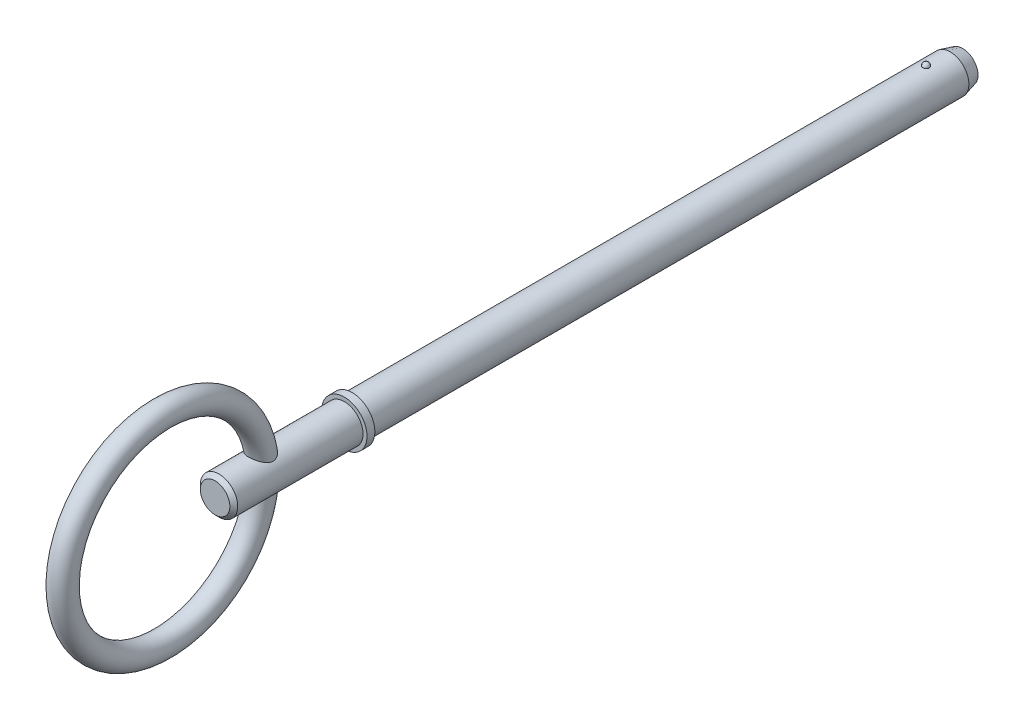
ISO-10303-21;
HEADER;
FILE_DESCRIPTION(('STEP AP214'),'2;1');
FILE_NAME('part.step','',(''),(''),'','','');
FILE_SCHEMA(('AUTOMOTIVE_DESIGN { 1 0 10303 214 1 1 1 1 }'));
ENDSEC;
DATA;
#1=APPLICATION_CONTEXT('core data for automotive mechanical design processes');
#2=APPLICATION_PROTOCOL_DEFINITION('international standard','automotive_design',2000,#1);
#3=PRODUCT_CONTEXT('',#1,'mechanical');
#4=PRODUCT('Part','Part','',(#3));
#5=PRODUCT_RELATED_PRODUCT_CATEGORY('part','',(#4));
#6=PRODUCT_DEFINITION_FORMATION('','',#4);
#7=PRODUCT_DEFINITION_CONTEXT('part definition',#1,'design');
#8=PRODUCT_DEFINITION('design','',#6,#7);
#9=PRODUCT_DEFINITION_SHAPE('','',#8);
#10=(LENGTH_UNIT() NAMED_UNIT(*) SI_UNIT(.MILLI.,.METRE.));
#11=(NAMED_UNIT(*) PLANE_ANGLE_UNIT() SI_UNIT($,.RADIAN.));
#12=(NAMED_UNIT(*) SI_UNIT($,.STERADIAN.) SOLID_ANGLE_UNIT());
#13=UNCERTAINTY_MEASURE_WITH_UNIT(LENGTH_MEASURE(1.E-05),#10,'distance_accuracy_value','');
#14=(GEOMETRIC_REPRESENTATION_CONTEXT(3) GLOBAL_UNCERTAINTY_ASSIGNED_CONTEXT((#13)) GLOBAL_UNIT_ASSIGNED_CONTEXT((#10,
#11,#12)) REPRESENTATION_CONTEXT('',''));
#15=CARTESIAN_POINT('',(0.,0.,0.));
#16=DIRECTION('',(0.,0.,1.));
#17=DIRECTION('',(1.,0.,0.));
#18=AXIS2_PLACEMENT_3D('',#15,#16,#17);
#19=CARTESIAN_POINT('',(0.,0.,72.6));
#20=DIRECTION('',(0.,0.,-1.));
#21=DIRECTION('',(-1.,0.,0.));
#22=AXIS2_PLACEMENT_3D('',#19,#20,#21);
#23=CYLINDRICAL_SURFACE('',#22,2.38);
#24=CARTESIAN_POINT('',(0.418361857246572,2.34294117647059,-0.419999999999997));
#25=CARTESIAN_POINT('',(0.418361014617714,2.34294160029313,-0.396453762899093));
#26=CARTESIAN_POINT('',(0.416399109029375,2.34329426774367,-0.372895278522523));
#27=CARTESIAN_POINT('',(0.408599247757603,2.34466666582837,-0.32643458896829));
#28=CARTESIAN_POINT('',(0.402757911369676,2.34568697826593,-0.303532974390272));
#29=CARTESIAN_POINT('',(0.387358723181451,2.3482789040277,-0.259059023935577));
#30=CARTESIAN_POINT('',(0.377802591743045,2.34985026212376,-0.237486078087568));
#31=CARTESIAN_POINT('',(0.355233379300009,2.35336760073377,-0.196270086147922));
#32=CARTESIAN_POINT('',(0.34222083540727,2.3553135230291,-0.176626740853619));
#33=CARTESIAN_POINT('',(0.313060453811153,2.35936636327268,-0.139777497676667));
#34=CARTESIAN_POINT('',(0.296906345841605,2.36147359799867,-0.122576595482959));
#35=CARTESIAN_POINT('',(0.261921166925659,2.3656092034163,-0.0911421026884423));
#36=CARTESIAN_POINT('',(0.243090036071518,2.36763757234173,-0.0769085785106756));
#37=CARTESIAN_POINT('',(0.203297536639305,2.37138533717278,-0.0518262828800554));
#38=CARTESIAN_POINT('',(0.182338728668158,2.37310509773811,-0.0409735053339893));
#39=CARTESIAN_POINT('',(0.138864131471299,2.37604521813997,-0.0229395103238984));
#40=CARTESIAN_POINT('',(0.116348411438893,2.37726560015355,-0.0157581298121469));
#41=CARTESIAN_POINT('',(0.0705754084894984,2.37906276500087,-0.00531205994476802));
#42=CARTESIAN_POINT('',(0.0473247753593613,2.37964420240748,-0.00201903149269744));
#43=CARTESIAN_POINT('',(0.000593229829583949,2.38011460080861,0.000651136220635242));
#44=CARTESIAN_POINT('',(-0.0228876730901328,2.38000359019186,2.84360175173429E-05));
#45=CARTESIAN_POINT('',(-0.0692686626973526,2.37910422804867,-0.00509943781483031));
#46=CARTESIAN_POINT('',(-0.0921713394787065,2.37831983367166,-0.00958192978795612));
#47=CARTESIAN_POINT('',(-0.136890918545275,2.37616546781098,-0.022272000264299));
#48=CARTESIAN_POINT('',(-0.158707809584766,2.37479549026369,-0.0304796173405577));
#49=CARTESIAN_POINT('',(-0.200704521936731,2.37161607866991,-0.0504168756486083));
#50=CARTESIAN_POINT('',(-0.220879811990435,2.36980547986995,-0.0621558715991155));
#51=CARTESIAN_POINT('',(-0.258974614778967,2.36594575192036,-0.0888218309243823));
#52=CARTESIAN_POINT('',(-0.276894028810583,2.36389661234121,-0.103748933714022));
#53=CARTESIAN_POINT('',(-0.310124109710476,2.35976825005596,-0.136509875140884));
#54=CARTESIAN_POINT('',(-0.325413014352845,2.35768891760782,-0.154365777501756));
#55=CARTESIAN_POINT('',(-0.352793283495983,2.35374782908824,-0.192402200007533));
#56=CARTESIAN_POINT('',(-0.364884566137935,2.35188607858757,-0.212582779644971));
#57=CARTESIAN_POINT('',(-0.385587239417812,2.34858114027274,-0.254794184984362));
#58=CARTESIAN_POINT('',(-0.394183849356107,2.34713973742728,-0.276832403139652));
#59=CARTESIAN_POINT('',(-0.407590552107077,2.3448489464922,-0.322061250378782));
#60=CARTESIAN_POINT('',(-0.412400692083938,2.34399955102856,-0.34525186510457));
#61=CARTESIAN_POINT('',(-0.418098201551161,2.34299005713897,-0.392078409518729));
#62=CARTESIAN_POINT('',(-0.41899328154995,2.34282860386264,-0.415713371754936));
#63=CARTESIAN_POINT('',(-0.416857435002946,2.34320955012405,-0.462799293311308));
#64=CARTESIAN_POINT('',(-0.413826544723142,2.34375194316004,-0.486250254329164));
#65=CARTESIAN_POINT('',(-0.403929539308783,2.34547773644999,-0.532261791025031));
#66=CARTESIAN_POINT('',(-0.397069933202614,2.34666004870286,-0.554823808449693));
#67=CARTESIAN_POINT('',(-0.379705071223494,2.34953208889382,-0.59846383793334));
#68=CARTESIAN_POINT('',(-0.369199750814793,2.35122182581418,-0.61954182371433));
#69=CARTESIAN_POINT('',(-0.344797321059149,2.35492396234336,-0.659671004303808));
#70=CARTESIAN_POINT('',(-0.33089223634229,2.35693711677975,-0.678717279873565));
#71=CARTESIAN_POINT('',(-0.300080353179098,2.36105754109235,-0.714192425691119));
#72=CARTESIAN_POINT('',(-0.283173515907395,2.36316481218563,-0.730621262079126));
#73=CARTESIAN_POINT('',(-0.246801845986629,2.36723962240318,-0.760416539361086));
#74=CARTESIAN_POINT('',(-0.227334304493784,2.36920701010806,-0.773779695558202));
#75=CARTESIAN_POINT('',(-0.186398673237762,2.37277833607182,-0.797042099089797));
#76=CARTESIAN_POINT('',(-0.164930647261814,2.37438228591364,-0.806941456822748));
#77=CARTESIAN_POINT('',(-0.120727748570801,2.37703848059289,-0.82294821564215));
#78=CARTESIAN_POINT('',(-0.0980005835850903,2.37809374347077,-0.829076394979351));
#79=CARTESIAN_POINT('',(-0.0518218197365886,2.37954782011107,-0.837451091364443));
#80=CARTESIAN_POINT('',(-0.0283702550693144,2.37994666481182,-0.839697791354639));
#81=CARTESIAN_POINT('',(0.0184023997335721,2.38004290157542,-0.840243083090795));
#82=CARTESIAN_POINT('',(0.0417231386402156,2.37974556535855,-0.838571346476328));
#83=CARTESIAN_POINT('',(0.0877471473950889,2.37849333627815,-0.831389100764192));
#84=CARTESIAN_POINT('',(0.110450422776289,2.37753844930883,-0.825878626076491));
#85=CARTESIAN_POINT('',(0.154584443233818,2.37507730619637,-0.811179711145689));
#86=CARTESIAN_POINT('',(0.17601599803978,2.37357140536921,-0.801993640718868));
#87=CARTESIAN_POINT('',(0.217028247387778,2.37017355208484,-0.780200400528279));
#88=CARTESIAN_POINT('',(0.236608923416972,2.36828159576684,-0.767593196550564));
#89=CARTESIAN_POINT('',(0.27351405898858,2.36430486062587,-0.739207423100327));
#90=CARTESIAN_POINT('',(0.290821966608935,2.36221883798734,-0.723407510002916));
#91=CARTESIAN_POINT('',(0.322554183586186,2.3580957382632,-0.68912612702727));
#92=CARTESIAN_POINT('',(0.336977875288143,2.35605867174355,-0.670644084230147));
#93=CARTESIAN_POINT('',(0.362636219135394,2.35224677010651,-0.63138169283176));
#94=CARTESIAN_POINT('',(0.373848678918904,2.35047379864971,-0.610586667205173));
#95=CARTESIAN_POINT('',(0.392641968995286,2.34740786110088,-0.567397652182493));
#96=CARTESIAN_POINT('',(0.400225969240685,2.34611447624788,-0.545005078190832));
#97=CARTESIAN_POINT('',(0.410033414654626,2.34441668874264,-0.505456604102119));
#98=CARTESIAN_POINT('',(0.413152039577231,2.34386644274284,-0.488523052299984));
#99=CARTESIAN_POINT('',(0.417316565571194,2.34312853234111,-0.454395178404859));
#100=CARTESIAN_POINT('',(0.418362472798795,2.34294086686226,-0.437200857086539));
#101=CARTESIAN_POINT('',(0.418361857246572,2.34294117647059,-0.419999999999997));
#102=B_SPLINE_CURVE_WITH_KNOTS('',3,(#24,#25,#26,#27,#28,#29,#30,#31,#32,#33,#34,#35,#36,#37,
#38,#39,#40,#41,#42,#43,#44,#45,#46,#47,#48,#49,#50,#51,#52,#53,#54,#55,#56,#57,#58,#59,#60,#61,
#62,#63,#64,#65,#66,#67,#68,#69,#70,#71,#72,#73,#74,#75,#76,#77,#78,#79,#80,#81,#82,#83,#84,#85,
#86,#87,#88,#89,#90,#91,#92,#93,#94,#95,#96,#97,#98,#99,#100,#101),.UNSPECIFIED.,.T.,.F.,(4,2,2,
2,2,2,2,2,2,2,2,2,2,2,2,2,2,2,2,2,2,2,2,2,2,2,2,2,2,2,2,2,2,2,2,2,2,2,4),(0.,0.0705763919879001,
0.141214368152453,0.211819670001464,0.282414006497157,0.353150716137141,0.423889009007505,
0.494543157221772,0.565194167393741,0.635327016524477,0.705456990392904,0.77517764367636,
0.844899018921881,0.914806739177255,0.98471751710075,1.05518143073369,1.1256471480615,
1.19640787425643,1.26716771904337,1.33778814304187,1.40840791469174,1.47890799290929,
1.54940931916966,1.62007764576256,1.69074688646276,1.76149149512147,1.83223384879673,
1.90258285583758,1.97292854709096,2.04274328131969,2.11255738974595,2.18232655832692,
2.25209642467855,2.32234913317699,2.39261687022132,2.4633591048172,2.5340394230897,
2.58559662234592,2.63715366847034),.UNSPECIFIED.);
#103=CARTESIAN_POINT('',(0.418361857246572,2.34294117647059,-0.419999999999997));
#104=VERTEX_POINT('',#103);
#105=EDGE_CURVE('E103',#104,#104,#102,.T.);
#106=ORIENTED_EDGE('',*,*,#105,.T.);
#107=EDGE_LOOP('',(#106));
#108=FACE_BOUND('',#107,.T.);
#109=CARTESIAN_POINT('',(0.,0.,-3.49399999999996));
#110=DIRECTION('',(0.,0.,-1.));
#111=DIRECTION('',(-1.,0.,0.));
#112=AXIS2_PLACEMENT_3D('',#109,#110,#111);
#113=CIRCLE('',#112,2.38);
#114=CARTESIAN_POINT('',(-2.38,0.,-3.49399999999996));
#115=VERTEX_POINT('',#114);
#116=EDGE_CURVE('E110',#115,#115,#113,.F.);
#117=ORIENTED_EDGE('',*,*,#116,.T.);
#118=EDGE_LOOP('',(#117));
#119=FACE_BOUND('',#118,.T.);
#120=CARTESIAN_POINT('',(0.,0.,72.6));
#121=DIRECTION('',(0.,0.,1.));
#122=DIRECTION('',(1.,0.,0.));
#123=AXIS2_PLACEMENT_3D('',#120,#121,#122);
#124=CIRCLE('',#123,2.38);
#125=CARTESIAN_POINT('',(2.38,0.,72.6));
#126=VERTEX_POINT('',#125);
#127=EDGE_CURVE('E108',#126,#126,#124,.T.);
#128=ORIENTED_EDGE('',*,*,#127,.F.);
#129=EDGE_LOOP('',(#128));
#130=FACE_BOUND('',#129,.T.);
#131=ADVANCED_FACE('F39',(#108,#119,#130),#23,.T.);
#132=CARTESIAN_POINT('',(0.,0.,-5.08));
#133=DIRECTION('',(0.,0.,-1.));
#134=DIRECTION('',(-1.,0.,0.));
#135=AXIS2_PLACEMENT_3D('',#132,#133,#134);
#136=PLANE('',#135);
#137=CARTESIAN_POINT('',(0.,0.,-5.08));
#138=DIRECTION('',(0.,0.,-1.));
#139=DIRECTION('',(-1.,0.,0.));
#140=AXIS2_PLACEMENT_3D('',#137,#138,#139);
#141=CIRCLE('',#140,1.95503258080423);
#142=CARTESIAN_POINT('',(-1.95503258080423,0.,-5.08));
#143=VERTEX_POINT('',#142);
#144=EDGE_CURVE('E143',#143,#143,#141,.T.);
#145=ORIENTED_EDGE('',*,*,#144,.T.);
#146=EDGE_LOOP('',(#145));
#147=FACE_BOUND('',#146,.T.);
#148=ADVANCED_FACE('F89',(#147),#136,.T.);
#149=CARTESIAN_POINT('',(0.,0.,-5.08));
#150=DIRECTION('',(0.,0.,1.));
#151=DIRECTION('',(1.,0.,0.));
#152=AXIS2_PLACEMENT_3D('',#149,#150,#151);
#153=CONICAL_SURFACE('',#152,1.95503258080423,0.261799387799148);
#154=ORIENTED_EDGE('',*,*,#116,.F.);
#155=EDGE_LOOP('',(#154));
#156=FACE_BOUND('',#155,.T.);
#157=ORIENTED_EDGE('',*,*,#144,.F.);
#158=EDGE_LOOP('',(#157));
#159=FACE_BOUND('',#158,.T.);
#160=ADVANCED_FACE('F95',(#156,#159),#153,.T.);
#161=CARTESIAN_POINT('',(0.,2.38,-0.419999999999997));
#162=DIRECTION('',(0.,1.,0.));
#163=DIRECTION('',(0.,0.,1.));
#164=AXIS2_PLACEMENT_3D('',#161,#162,#163);
#165=SPHERICAL_SURFACE('',#164,0.419999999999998);
#166=ORIENTED_EDGE('',*,*,#105,.F.);
#167=EDGE_LOOP('',(#166));
#168=FACE_BOUND('',#167,.T.);
#169=ADVANCED_FACE('F113',(#168),#165,.T.);
#170=CARTESIAN_POINT('',(0.,0.,72.6));
#171=DIRECTION('',(0.,0.,-1.));
#172=DIRECTION('',(-1.,0.,0.));
#173=AXIS2_PLACEMENT_3D('',#170,#171,#172);
#174=PLANE('',#173);
#175=ORIENTED_EDGE('',*,*,#127,.T.);
#176=EDGE_LOOP('',(#175));
#177=FACE_BOUND('',#176,.T.);
#178=CARTESIAN_POINT('',(0.,0.,72.6));
#179=DIRECTION('',(0.,0.,-1.));
#180=DIRECTION('',(-1.,0.,0.));
#181=AXIS2_PLACEMENT_3D('',#178,#179,#180);
#182=CIRCLE('',#181,2.88);
#183=CARTESIAN_POINT('',(-2.88,0.,72.6));
#184=VERTEX_POINT('',#183);
#185=EDGE_CURVE('E109',#184,#184,#182,.T.);
#186=ORIENTED_EDGE('',*,*,#185,.T.);
#187=EDGE_LOOP('',(#186));
#188=FACE_BOUND('',#187,.T.);
#189=ADVANCED_FACE('F117',(#177,#188),#174,.T.);
#190=CARTESIAN_POINT('',(0.,0.,33.7287874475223));
#191=DIRECTION('',(0.,0.,-1.));
#192=DIRECTION('',(-1.,0.,0.));
#193=AXIS2_PLACEMENT_3D('',#190,#191,#192);
#194=CYLINDRICAL_SURFACE('',#193,2.88);
#195=CARTESIAN_POINT('',(0.,0.,73.6));
#196=DIRECTION('',(0.,0.,-1.));
#197=DIRECTION('',(-1.,0.,0.));
#198=AXIS2_PLACEMENT_3D('',#195,#196,#197);
#199=CIRCLE('',#198,2.88);
#200=CARTESIAN_POINT('',(-2.88,0.,73.6));
#201=VERTEX_POINT('',#200);
#202=EDGE_CURVE('E134',#201,#201,#199,.T.);
#203=ORIENTED_EDGE('',*,*,#202,.T.);
#204=EDGE_LOOP('',(#203));
#205=FACE_BOUND('',#204,.T.);
#206=ORIENTED_EDGE('',*,*,#185,.F.);
#207=EDGE_LOOP('',(#206));
#208=FACE_BOUND('',#207,.T.);
#209=ADVANCED_FACE('F121',(#205,#208),#194,.T.);
#210=CARTESIAN_POINT('',(0.,2.88,73.6));
#211=DIRECTION('',(0.,0.,1.));
#212=DIRECTION('',(1.,0.,0.));
#213=AXIS2_PLACEMENT_3D('',#210,#211,#212);
#214=PLANE('',#213);
#215=CARTESIAN_POINT('',(0.,0.,73.6));
#216=DIRECTION('',(0.,0.,1.));
#217=DIRECTION('',(1.,0.,0.));
#218=AXIS2_PLACEMENT_3D('',#215,#216,#217);
#219=CIRCLE('',#218,2.38);
#220=CARTESIAN_POINT('',(2.38,0.,73.6));
#221=VERTEX_POINT('',#220);
#222=EDGE_CURVE('E112',#221,#221,#219,.T.);
#223=ORIENTED_EDGE('',*,*,#222,.F.);
#224=EDGE_LOOP('',(#223));
#225=FACE_BOUND('',#224,.T.);
#226=ORIENTED_EDGE('',*,*,#202,.F.);
#227=EDGE_LOOP('',(#226));
#228=FACE_BOUND('',#227,.T.);
#229=ADVANCED_FACE('F86',(#225,#228),#214,.T.);
#230=CARTESIAN_POINT('',(0.,0.,90.05));
#231=DIRECTION('',(0.,0.,-1.));
#232=DIRECTION('',(-1.,0.,0.));
#233=AXIS2_PLACEMENT_3D('',#230,#231,#232);
#234=CYLINDRICAL_SURFACE('',#233,2.38);
#235=CARTESIAN_POINT('',(-0.903407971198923,-2.20187511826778,83.028101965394));
#236=CARTESIAN_POINT('',(-0.839710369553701,-2.22800560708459,82.9836275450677));
#237=CARTESIAN_POINT('',(-0.771955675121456,-2.25255828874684,82.9439200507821));
#238=CARTESIAN_POINT('',(-0.629623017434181,-2.29641711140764,82.8749006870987));
#239=CARTESIAN_POINT('',(-0.555034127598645,-2.31571464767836,82.8456058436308));
#240=CARTESIAN_POINT('',(-0.400673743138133,-2.34735542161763,82.7982943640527));
#241=CARTESIAN_POINT('',(-0.320887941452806,-2.35967847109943,82.7803104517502));
#242=CARTESIAN_POINT('',(-0.158738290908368,-2.37609587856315,82.7564617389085));
#243=CARTESIAN_POINT('',(-0.0763765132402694,-2.38019668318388,82.7505874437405));
#244=CARTESIAN_POINT('',(0.083665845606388,-2.3797998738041,82.7511603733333));
#245=CARTESIAN_POINT('',(0.161351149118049,-2.37576936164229,82.7569382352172));
#246=CARTESIAN_POINT('',(0.314409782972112,-2.36039486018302,82.7792676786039));
#247=CARTESIAN_POINT('',(0.389782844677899,-2.34905002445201,82.7958205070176));
#248=CARTESIAN_POINT('',(0.535937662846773,-2.32006569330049,82.8390515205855));
#249=CARTESIAN_POINT('',(0.60673584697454,-2.30245039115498,82.8656908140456));
#250=CARTESIAN_POINT('',(0.742521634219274,-2.26231731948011,82.9283720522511));
#251=CARTESIAN_POINT('',(0.807508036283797,-2.23979853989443,82.9644159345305));
#252=CARTESIAN_POINT('',(0.935326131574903,-2.18966592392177,83.0483563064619));
#253=CARTESIAN_POINT('',(0.997591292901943,-2.16179128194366,83.0969595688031));
#254=CARTESIAN_POINT('',(1.11292144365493,-2.10474548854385,83.2035603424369));
#255=CARTESIAN_POINT('',(1.16597568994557,-2.07557287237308,83.2615686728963));
#256=CARTESIAN_POINT('',(1.26477130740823,-2.01699124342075,83.3902977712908));
#257=CARTESIAN_POINT('',(1.30983402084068,-1.98768494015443,83.4615920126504));
#258=CARTESIAN_POINT('',(1.38660631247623,-1.93491744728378,83.6129637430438));
#259=CARTESIAN_POINT('',(1.41834090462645,-1.91144534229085,83.6930244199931));
#260=CARTESIAN_POINT('',(1.46422131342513,-1.87648847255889,83.8506940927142));
#261=CARTESIAN_POINT('',(1.47990731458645,-1.86397592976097,83.9276190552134));
#262=CARTESIAN_POINT('',(1.49871691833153,-1.84889326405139,84.0838974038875));
#263=CARTESIAN_POINT('',(1.50185388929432,-1.84631256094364,84.1632481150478));
#264=CARTESIAN_POINT('',(1.4964844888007,-1.85065563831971,84.3088470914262));
#265=CARTESIAN_POINT('',(1.48970686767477,-1.85616871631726,84.3752204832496));
#266=CARTESIAN_POINT('',(1.46828795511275,-1.87315650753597,84.5059075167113));
#267=CARTESIAN_POINT('',(1.4536391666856,-1.88463690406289,84.5702191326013));
#268=CARTESIAN_POINT('',(1.40943250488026,-1.91806137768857,84.7230643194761));
#269=CARTESIAN_POINT('',(1.37616344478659,-1.94238425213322,84.8099991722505));
#270=CARTESIAN_POINT('',(1.29708737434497,-1.99605834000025,84.9763485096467));
#271=CARTESIAN_POINT('',(1.25125268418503,-2.02542060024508,85.055745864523));
#272=CARTESIAN_POINT('',(1.14695036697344,-2.08629729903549,85.2076285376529));
#273=CARTESIAN_POINT('',(1.08823347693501,-2.11784433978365,85.2799296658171));
#274=CARTESIAN_POINT('',(0.959228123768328,-2.17930599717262,85.4140708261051));
#275=CARTESIAN_POINT('',(0.888958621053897,-2.20922318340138,85.4759276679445));
#276=CARTESIAN_POINT('',(0.753368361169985,-2.25851185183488,85.5749333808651));
#277=CARTESIAN_POINT('',(0.690173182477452,-2.2787729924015,85.6145392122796));
#278=CARTESIAN_POINT('',(0.557409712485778,-2.31482439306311,85.6839846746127));
#279=CARTESIAN_POINT('',(0.487846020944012,-2.33061784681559,85.7138312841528));
#280=CARTESIAN_POINT('',(0.342953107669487,-2.35631858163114,85.7620255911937));
#281=CARTESIAN_POINT('',(0.26757466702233,-2.36616750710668,85.780259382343));
#282=CARTESIAN_POINT('',(0.114199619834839,-2.37849775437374,85.8030468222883));
#283=CARTESIAN_POINT('',(0.0362059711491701,-2.3809871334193,85.8076154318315));
#284=CARTESIAN_POINT('',(-0.107568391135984,-2.37849121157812,85.8030163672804));
#285=CARTESIAN_POINT('',(-0.173440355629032,-2.37456249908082,85.795790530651));
#286=CARTESIAN_POINT('',(-0.302853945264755,-2.36154811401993,85.7716908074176));
#287=CARTESIAN_POINT('',(-0.366395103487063,-2.35246141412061,85.7548149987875));
#288=CARTESIAN_POINT('',(-0.489880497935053,-2.32988758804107,85.7124346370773));
#289=CARTESIAN_POINT('',(-0.549812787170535,-2.31638670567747,85.6869031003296));
#290=CARTESIAN_POINT('',(-0.665021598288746,-2.28597979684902,85.6284893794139));
#291=CARTESIAN_POINT('',(-0.720295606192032,-2.26907194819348,85.5956032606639));
#292=CARTESIAN_POINT('',(-0.851132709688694,-2.22413718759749,85.5063110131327));
#293=CARTESIAN_POINT('',(-0.923680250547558,-2.19467168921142,85.4461969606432));
#294=CARTESIAN_POINT('',(-1.05722916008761,-2.13356097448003,85.3150668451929));
#295=CARTESIAN_POINT('',(-1.11820078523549,-2.10191042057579,85.2440235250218));
#296=CARTESIAN_POINT('',(-1.22894457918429,-2.0391654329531,85.0916118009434));
#297=CARTESIAN_POINT('',(-1.27853191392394,-2.00808682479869,85.0101025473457));
#298=CARTESIAN_POINT('',(-1.36422650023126,-1.95088121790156,84.8387530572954));
#299=CARTESIAN_POINT('',(-1.40036235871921,-1.92474376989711,84.7489310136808));
#300=CARTESIAN_POINT('',(-1.44943039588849,-1.88791548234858,84.5877392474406));
#301=CARTESIAN_POINT('',(-1.46600167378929,-1.87495651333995,84.5180059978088));
#302=CARTESIAN_POINT('',(-1.48984634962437,-1.8560704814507,84.3760551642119));
#303=CARTESIAN_POINT('',(-1.49713400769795,-1.85013263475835,84.303841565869));
#304=CARTESIAN_POINT('',(-1.5014924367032,-1.84660099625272,84.1583634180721));
#305=CARTESIAN_POINT('',(-1.4984943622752,-1.84906342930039,84.0850950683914));
#306=CARTESIAN_POINT('',(-1.48179888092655,-1.8624661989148,83.9405680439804));
#307=CARTESIAN_POINT('',(-1.46809860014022,-1.87340881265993,83.869309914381));
#308=CARTESIAN_POINT('',(-1.43218989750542,-1.90096973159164,83.7372815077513));
#309=CARTESIAN_POINT('',(-1.41085045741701,-1.91699396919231,83.6761429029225));
#310=CARTESIAN_POINT('',(-1.36038958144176,-1.95312601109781,83.5584385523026));
#311=CARTESIAN_POINT('',(-1.33126141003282,-1.97323734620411,83.5018768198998));
#312=CARTESIAN_POINT('',(-1.2617310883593,-2.01850590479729,83.3870500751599));
#313=CARTESIAN_POINT('',(-1.22036168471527,-2.04397945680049,83.3294985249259));
#314=CARTESIAN_POINT('',(-1.12954254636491,-2.09553139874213,83.2216488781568));
#315=CARTESIAN_POINT('',(-1.08010424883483,-2.12160888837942,83.1713407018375));
#316=CARTESIAN_POINT('',(-0.987769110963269,-2.16578285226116,83.0904848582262));
#317=CARTESIAN_POINT('',(-0.946517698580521,-2.18419033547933,83.0582016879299));
#318=CARTESIAN_POINT('',(-0.903407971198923,-2.20187511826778,83.028101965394));
#319=B_SPLINE_CURVE_WITH_KNOTS('',3,(#235,#236,#237,#238,#239,#240,#241,#242,#243,#244,#245,
#246,#247,#248,#249,#250,#251,#252,#253,#254,#255,#256,#257,#258,#259,#260,#261,#262,#263,#264,
#265,#266,#267,#268,#269,#270,#271,#272,#273,#274,#275,#276,#277,#278,#279,#280,#281,#282,#283,
#284,#285,#286,#287,#288,#289,#290,#291,#292,#293,#294,#295,#296,#297,#298,#299,#300,#301,#302,
#303,#304,#305,#306,#307,#308,#309,#310,#311,#312,#313,#314,#315,#316,#317,#318),.UNSPECIFIED.,
.T.,.F.,(4,2,2,2,2,2,2,2,2,2,2,2,2,2,2,2,2,2,2,2,2,2,2,2,2,2,2,2,2,2,2,2,2,2,2,2,2,2,2,2,2,4),
(0.,0.245727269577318,0.491854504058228,0.738690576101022,0.985333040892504,1.21821047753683,
1.45111486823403,1.68313021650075,1.9151934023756,2.16541572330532,2.41592795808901,
2.68235417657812,2.9482781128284,3.18521517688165,3.42189976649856,3.62191159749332,
3.82211427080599,4.10918949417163,4.39690224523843,4.69076958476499,4.98415935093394,
5.2151557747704,5.4459866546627,5.67904815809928,5.91185441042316,6.11003726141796,
6.3082595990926,6.50710565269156,6.70605834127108,7.00062466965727,7.29593791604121,
7.59575158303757,7.8949239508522,8.11262207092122,8.329985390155,8.54880641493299,
8.76768621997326,8.96702101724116,9.16652875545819,9.39164791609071,9.61645071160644,
9.78275580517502),.UNSPECIFIED.);
#320=CARTESIAN_POINT('',(-0.903407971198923,-2.20187511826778,83.028101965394));
#321=VERTEX_POINT('',#320);
#322=EDGE_CURVE('E10',#321,#321,#319,.T.);
#323=ORIENTED_EDGE('',*,*,#322,.F.);
#324=EDGE_LOOP('',(#323));
#325=FACE_BOUND('',#324,.T.);
#326=CARTESIAN_POINT('',(-0.903407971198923,2.20187511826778,83.028101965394));
#327=CARTESIAN_POINT('',(-0.970214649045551,2.17445928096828,83.0747550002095));
#328=CARTESIAN_POINT('',(-1.03268838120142,2.14525344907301,83.1267440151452));
#329=CARTESIAN_POINT('',(-1.14770770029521,2.0859961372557,83.2406478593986));
#330=CARTESIAN_POINT('',(-1.20022114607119,2.05594226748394,83.3025936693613));
#331=CARTESIAN_POINT('',(-1.2941155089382,1.99817720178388,83.4359266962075));
#332=CARTESIAN_POINT('',(-1.33544720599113,1.9704767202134,83.5073536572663));
#333=CARTESIAN_POINT('',(-1.40506760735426,1.92146090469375,83.6582024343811));
#334=CARTESIAN_POINT('',(-1.43339046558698,1.90012890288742,83.7376026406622));
#335=CARTESIAN_POINT('',(-1.47338334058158,1.86925714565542,83.8934496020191));
#336=CARTESIAN_POINT('',(-1.48649837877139,1.85870842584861,83.9693198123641));
#337=CARTESIAN_POINT('',(-1.50071746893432,1.8472518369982,84.12287045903));
#338=CARTESIAN_POINT('',(-1.50182784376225,1.84633889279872,84.2005499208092));
#339=CARTESIAN_POINT('',(-1.49326645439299,1.85325786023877,84.343985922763));
#340=CARTESIAN_POINT('',(-1.48506604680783,1.85989666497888,84.4099043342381));
#341=CARTESIAN_POINT('',(-1.46099386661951,1.87886395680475,84.5394790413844));
#342=CARTESIAN_POINT('',(-1.44511553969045,1.8911973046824,84.6031333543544));
#343=CARTESIAN_POINT('',(-1.39754250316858,1.92678855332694,84.7561538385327));
#344=CARTESIAN_POINT('',(-1.36192725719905,1.95245999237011,84.8437372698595));
#345=CARTESIAN_POINT('',(-1.27788657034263,2.00847209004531,85.0109907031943));
#346=CARTESIAN_POINT('',(-1.22943137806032,2.0388235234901,85.0906417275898));
#347=CARTESIAN_POINT('',(-1.11958027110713,2.10119412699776,85.2424206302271));
#348=CARTESIAN_POINT('',(-1.05794784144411,2.13323438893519,85.3143690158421));
#349=CARTESIAN_POINT('',(-0.922772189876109,2.1950849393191,85.4470807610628));
#350=CARTESIAN_POINT('',(-0.849252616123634,2.22489948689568,85.5078658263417));
#351=CARTESIAN_POINT('',(-0.710152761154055,2.27246326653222,85.6023110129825));
#352=CARTESIAN_POINT('',(-0.647015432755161,2.29138112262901,85.6389704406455));
#353=CARTESIAN_POINT('',(-0.514878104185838,2.32463484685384,85.7025884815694));
#354=CARTESIAN_POINT('',(-0.445882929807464,2.33897444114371,85.7295549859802));
#355=CARTESIAN_POINT('',(-0.302797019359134,2.36177853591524,85.7721624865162));
#356=CARTESIAN_POINT('',(-0.228666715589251,2.37019011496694,85.7877015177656));
#357=CARTESIAN_POINT('',(-0.0783799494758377,2.37989644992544,85.8056164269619));
#358=CARTESIAN_POINT('',(-0.00222521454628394,2.38119708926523,85.8080031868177));
#359=CARTESIAN_POINT('',(0.138818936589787,2.37685303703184,85.7999981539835));
#360=CARTESIAN_POINT('',(0.203841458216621,2.37212211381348,85.7912876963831));
#361=CARTESIAN_POINT('',(0.331347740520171,2.35769527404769,85.7645309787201));
#362=CARTESIAN_POINT('',(0.393830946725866,2.34799827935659,85.7464826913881));
#363=CARTESIAN_POINT('',(0.516206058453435,2.32419976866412,85.7016833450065));
#364=CARTESIAN_POINT('',(0.576015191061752,2.31000942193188,85.6747562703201));
#365=CARTESIAN_POINT('',(0.690806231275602,2.27831963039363,85.6136110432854));
#366=CARTESIAN_POINT('',(0.745785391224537,2.26081831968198,85.579388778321));
#367=CARTESIAN_POINT('',(0.876071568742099,2.2144370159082,85.4866108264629));
#368=CARTESIAN_POINT('',(0.948236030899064,2.18416686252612,85.424322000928));
#369=CARTESIAN_POINT('',(1.08068664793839,2.12176774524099,85.2888044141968));
#370=CARTESIAN_POINT('',(1.14094076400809,2.08963406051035,85.215547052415));
#371=CARTESIAN_POINT('',(1.24978363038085,2.02643655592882,85.058659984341));
#372=CARTESIAN_POINT('',(1.29819307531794,1.99539463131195,84.9748968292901));
#373=CARTESIAN_POINT('',(1.38094965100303,1.93904233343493,84.7989962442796));
#374=CARTESIAN_POINT('',(1.41533296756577,1.91371728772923,84.7068811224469));
#375=CARTESIAN_POINT('',(1.46011713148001,1.87962907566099,84.543926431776));
#376=CARTESIAN_POINT('',(1.47459501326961,1.86818653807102,84.4747778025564));
#377=CARTESIAN_POINT('',(1.49436605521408,1.8524142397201,84.334403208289));
#378=CARTESIAN_POINT('',(1.49967306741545,1.84807375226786,84.2631805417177));
#379=CARTESIAN_POINT('',(1.50029887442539,1.84756805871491,84.1202291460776));
#380=CARTESIAN_POINT('',(1.49556248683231,1.8514480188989,84.048499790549));
#381=CARTESIAN_POINT('',(1.4758165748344,1.86722196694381,83.9073512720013));
#382=CARTESIAN_POINT('',(1.46080121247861,1.87912050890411,83.8379334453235));
#383=CARTESIAN_POINT('',(1.42246467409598,1.90827733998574,83.7082199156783));
#384=CARTESIAN_POINT('',(1.39980172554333,1.92509995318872,83.6476260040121));
#385=CARTESIAN_POINT('',(1.34679091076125,1.96255086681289,83.5311857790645));
#386=CARTESIAN_POINT('',(1.31644034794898,1.98318050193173,83.4753411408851));
#387=CARTESIAN_POINT('',(1.24396057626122,2.02954647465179,83.3614514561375));
#388=CARTESIAN_POINT('',(1.20077385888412,2.05559269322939,83.3042068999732));
#389=CARTESIAN_POINT('',(1.10616417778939,2.10801594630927,83.1971320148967));
#390=CARTESIAN_POINT('',(1.05473535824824,2.13439320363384,83.1473070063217));
#391=CARTESIAN_POINT('',(0.93620270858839,2.18924478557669,83.0487347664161));
#392=CARTESIAN_POINT('',(0.867904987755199,2.21744450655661,83.0012583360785));
#393=CARTESIAN_POINT('',(0.722917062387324,2.26885521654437,82.9177494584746));
#394=CARTESIAN_POINT('',(0.646227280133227,2.29206645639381,82.8817164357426));
#395=CARTESIAN_POINT('',(0.487515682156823,2.33094430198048,82.822591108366));
#396=CARTESIAN_POINT('',(0.405587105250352,2.34671524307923,82.7993190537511));
#397=CARTESIAN_POINT('',(0.237955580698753,2.36958127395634,82.7658521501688));
#398=CARTESIAN_POINT('',(0.152255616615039,2.37668309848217,82.7556471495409));
#399=CARTESIAN_POINT('',(-0.0122990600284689,2.38126478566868,82.7490505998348));
#400=CARTESIAN_POINT('',(-0.0910885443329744,2.37954037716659,82.7515167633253));
#401=CARTESIAN_POINT('',(-0.247004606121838,2.36843740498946,82.7675699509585));
#402=CARTESIAN_POINT('',(-0.324130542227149,2.35905594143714,82.7811611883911));
#403=CARTESIAN_POINT('',(-0.473048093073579,2.33371594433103,82.8185984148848));
#404=CARTESIAN_POINT('',(-0.544914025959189,2.31788812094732,82.8422409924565));
#405=CARTESIAN_POINT('',(-0.683201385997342,2.28095222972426,82.8990265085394));
#406=CARTESIAN_POINT('',(-0.74963171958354,2.25985303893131,82.9321534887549));
#407=CARTESIAN_POINT('',(-0.843767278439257,2.22565914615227,82.9880726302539));
#408=CARTESIAN_POINT('',(-0.874007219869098,2.21394047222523,83.0075705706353));
#409=CARTESIAN_POINT('',(-0.903407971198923,2.20187511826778,83.028101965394));
#410=B_SPLINE_CURVE_WITH_KNOTS('',3,(#326,#327,#328,#329,#330,#331,#332,#333,#334,#335,#336,
#337,#338,#339,#340,#341,#342,#343,#344,#345,#346,#347,#348,#349,#350,#351,#352,#353,#354,#355,
#356,#357,#358,#359,#360,#361,#362,#363,#364,#365,#366,#367,#368,#369,#370,#371,#372,#373,#374,
#375,#376,#377,#378,#379,#380,#381,#382,#383,#384,#385,#386,#387,#388,#389,#390,#391,#392,#393,
#394,#395,#396,#397,#398,#399,#400,#401,#402,#403,#404,#405,#406,#407,#408,#409),.UNSPECIFIED.,
.T.,.F.,(4,2,2,2,2,2,2,2,2,2,2,2,2,2,2,2,2,2,2,2,2,2,2,2,2,2,2,2,2,2,2,2,2,2,2,2,2,2,2,2,2,4),
(0.,0.257815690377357,0.516449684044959,0.776204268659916,1.03527292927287,1.26692758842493,
1.49846022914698,1.69794041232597,1.89759118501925,2.1899309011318,2.48295401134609,
2.78175997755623,3.07997865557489,3.30539912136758,3.53063565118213,3.75785831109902,
3.98489294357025,4.18128296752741,4.37771564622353,4.57830350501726,4.77900474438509,
5.07746482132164,5.37671714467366,5.68025255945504,5.982999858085,6.19688795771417,
6.41045270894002,6.62519390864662,6.84005717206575,7.03981304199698,7.23963907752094,
7.46764796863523,7.69581957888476,7.9580466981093,8.2202606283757,8.47867938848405,
8.73689726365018,8.97226876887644,9.20772945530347,9.43863631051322,9.66915690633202,
9.78261824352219),.UNSPECIFIED.);
#411=CARTESIAN_POINT('',(-0.903407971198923,2.20187511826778,83.028101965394));
#412=VERTEX_POINT('',#411);
#413=EDGE_CURVE('E51',#412,#412,#410,.T.);
#414=ORIENTED_EDGE('',*,*,#413,.F.);
#415=EDGE_LOOP('',(#414));
#416=FACE_BOUND('',#415,.T.);
#417=CARTESIAN_POINT('',(0.,0.,89.55));
#418=DIRECTION('',(0.,0.,-1.));
#419=DIRECTION('',(-1.,0.,0.));
#420=AXIS2_PLACEMENT_3D('',#417,#418,#419);
#421=CIRCLE('',#420,2.38);
#422=CARTESIAN_POINT('',(-2.38,0.,89.55));
#423=VERTEX_POINT('',#422);
#424=EDGE_CURVE('E65',#423,#423,#421,.T.);
#425=ORIENTED_EDGE('',*,*,#424,.T.);
#426=EDGE_LOOP('',(#425));
#427=FACE_BOUND('',#426,.T.);
#428=ORIENTED_EDGE('',*,*,#222,.T.);
#429=EDGE_LOOP('',(#428));
#430=FACE_BOUND('',#429,.T.);
#431=ADVANCED_FACE('F70',(#325,#416,#427,#430),#234,.T.);
#432=CARTESIAN_POINT('',(0.,0.,90.05));
#433=DIRECTION('',(0.,0.,-1.));
#434=DIRECTION('',(-1.,0.,0.));
#435=AXIS2_PLACEMENT_3D('',#432,#433,#434);
#436=PLANE('',#435);
#437=CARTESIAN_POINT('',(0.,0.,90.05));
#438=DIRECTION('',(0.,0.,-1.));
#439=DIRECTION('',(-1.,0.,0.));
#440=AXIS2_PLACEMENT_3D('',#437,#438,#439);
#441=CIRCLE('',#440,1.87999999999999);
#442=CARTESIAN_POINT('',(-1.87999999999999,0.,90.05));
#443=VERTEX_POINT('',#442);
#444=EDGE_CURVE('E58',#443,#443,#441,.F.);
#445=ORIENTED_EDGE('',*,*,#444,.T.);
#446=EDGE_LOOP('',(#445));
#447=FACE_BOUND('',#446,.T.);
#448=ADVANCED_FACE('F77',(#447),#436,.F.);
#449=CARTESIAN_POINT('',(0.,0.,89.55));
#450=DIRECTION('',(0.,0.,-1.));
#451=DIRECTION('',(-1.,0.,0.));
#452=AXIS2_PLACEMENT_3D('',#449,#450,#451);
#453=CONICAL_SURFACE('',#452,2.38,0.785398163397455);
#454=ORIENTED_EDGE('',*,*,#444,.F.);
#455=EDGE_LOOP('',(#454));
#456=FACE_BOUND('',#455,.T.);
#457=ORIENTED_EDGE('',*,*,#424,.F.);
#458=EDGE_LOOP('',(#457));
#459=FACE_BOUND('',#458,.T.);
#460=ADVANCED_FACE('F41',(#456,#459),#453,.T.);
#461=CARTESIAN_POINT('',(0.,0.,96.75));
#462=DIRECTION('',(1.,0.,0.));
#463=DIRECTION('',(0.,0.,-1.));
#464=AXIS2_PLACEMENT_3D('',#461,#462,#463);
#465=TOROIDAL_SURFACE('',#464,12.7,1.5);
#466=ORIENTED_EDGE('',*,*,#322,.T.);
#467=EDGE_LOOP('',(#466));
#468=FACE_BOUND('',#467,.T.);
#469=ORIENTED_EDGE('',*,*,#413,.T.);
#470=EDGE_LOOP('',(#469));
#471=FACE_BOUND('',#470,.T.);
#472=ADVANCED_FACE('F74',(#468,#471),#465,.T.);
#473=CLOSED_SHELL('',(#131,#148,#160,#169,#189,#209,#229,#431,#448,#460,#472));
#474=MANIFOLD_SOLID_BREP('B2',#473);
#475=ADVANCED_BREP_SHAPE_REPRESENTATION('',(#18,#474),#14);
#476=SHAPE_DEFINITION_REPRESENTATION(#9,#475);
ENDSEC;
END-ISO-10303-21;
